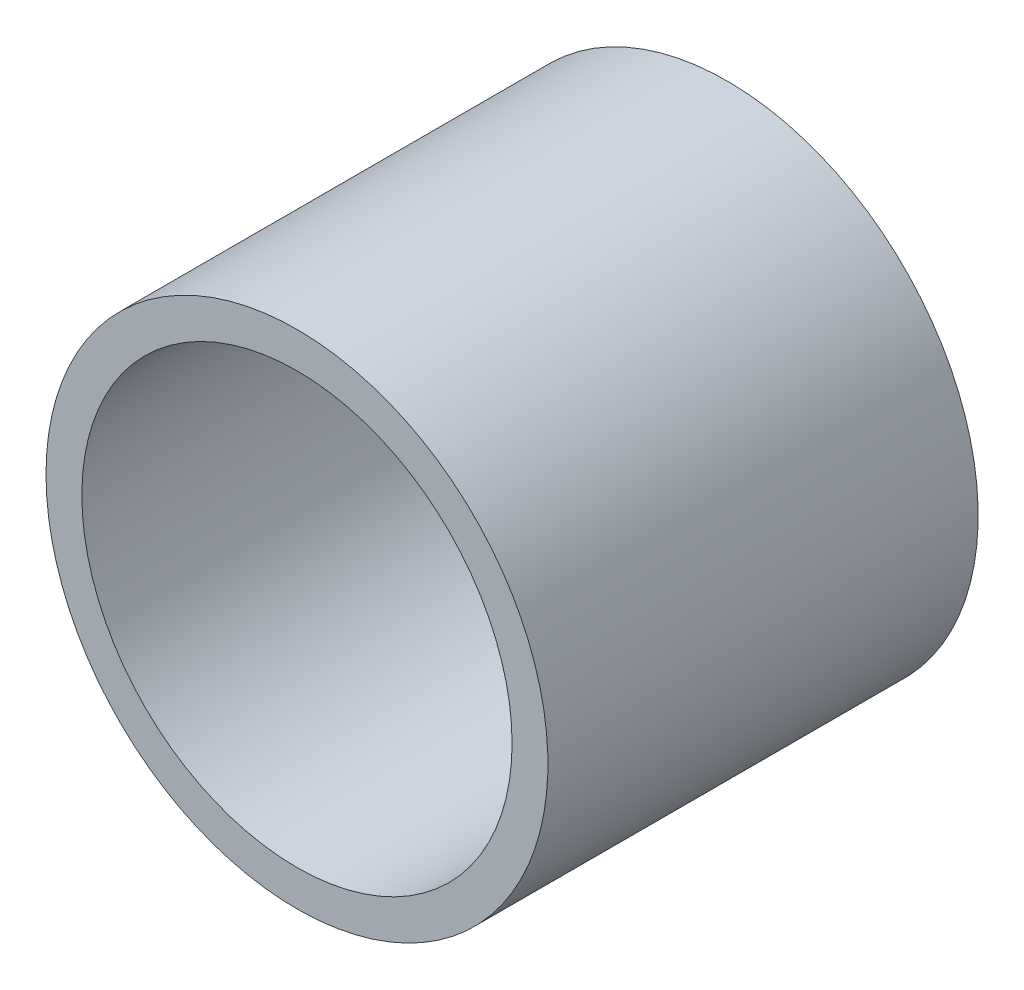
ISO-10303-21;
HEADER;
FILE_DESCRIPTION(('STEP AP214'),'2;1');
FILE_NAME('part.step','',(''),(''),'','','');
FILE_SCHEMA(('AUTOMOTIVE_DESIGN { 1 0 10303 214 1 1 1 1 }'));
ENDSEC;
DATA;
#1=APPLICATION_CONTEXT('core data for automotive mechanical design processes');
#2=APPLICATION_PROTOCOL_DEFINITION('international standard','automotive_design',2000,#1);
#3=PRODUCT_CONTEXT('',#1,'mechanical');
#4=PRODUCT('Part','Part','',(#3));
#5=PRODUCT_RELATED_PRODUCT_CATEGORY('part','',(#4));
#6=PRODUCT_DEFINITION_FORMATION('','',#4);
#7=PRODUCT_DEFINITION_CONTEXT('part definition',#1,'design');
#8=PRODUCT_DEFINITION('design','',#6,#7);
#9=PRODUCT_DEFINITION_SHAPE('','',#8);
#10=(LENGTH_UNIT() NAMED_UNIT(*) SI_UNIT(.MILLI.,.METRE.));
#11=(NAMED_UNIT(*) PLANE_ANGLE_UNIT() SI_UNIT($,.RADIAN.));
#12=(NAMED_UNIT(*) SI_UNIT($,.STERADIAN.) SOLID_ANGLE_UNIT());
#13=UNCERTAINTY_MEASURE_WITH_UNIT(LENGTH_MEASURE(1.E-05),#10,'distance_accuracy_value','');
#14=(GEOMETRIC_REPRESENTATION_CONTEXT(3) GLOBAL_UNCERTAINTY_ASSIGNED_CONTEXT((#13)) GLOBAL_UNIT_ASSIGNED_CONTEXT((#10,
#11,#12)) REPRESENTATION_CONTEXT('',''));
#15=CARTESIAN_POINT('',(0.,0.,0.));
#16=DIRECTION('',(0.,0.,1.));
#17=DIRECTION('',(1.,0.,0.));
#18=AXIS2_PLACEMENT_3D('',#15,#16,#17);
#19=CARTESIAN_POINT('',(0.,0.,17.));
#20=DIRECTION('',(0.,0.,-1.));
#21=DIRECTION('',(-1.,0.,0.));
#22=AXIS2_PLACEMENT_3D('',#19,#20,#21);
#23=CYLINDRICAL_SURFACE('',#22,7.);
#24=CARTESIAN_POINT('',(0.,0.,12.));
#25=DIRECTION('',(0.,0.,-1.));
#26=DIRECTION('',(-1.,0.,0.));
#27=AXIS2_PLACEMENT_3D('',#24,#25,#26);
#28=CIRCLE('',#27,7.);
#29=CARTESIAN_POINT('',(-7.,0.,12.));
#30=VERTEX_POINT('',#29);
#31=EDGE_CURVE('E10',#30,#30,#28,.T.);
#32=ORIENTED_EDGE('',*,*,#31,.T.);
#33=EDGE_LOOP('',(#32));
#34=FACE_BOUND('',#33,.T.);
#35=CARTESIAN_POINT('',(0.,0.,0.));
#36=DIRECTION('',(0.,0.,-1.));
#37=DIRECTION('',(-1.,0.,0.));
#38=AXIS2_PLACEMENT_3D('',#35,#36,#37);
#39=CIRCLE('',#38,7.);
#40=CARTESIAN_POINT('',(-7.,0.,0.));
#41=VERTEX_POINT('',#40);
#42=EDGE_CURVE('E43',#41,#41,#39,.T.);
#43=ORIENTED_EDGE('',*,*,#42,.F.);
#44=EDGE_LOOP('',(#43));
#45=FACE_BOUND('',#44,.T.);
#46=ADVANCED_FACE('F29',(#34,#45),#23,.T.);
#47=CARTESIAN_POINT('',(7.,0.,12.));
#48=DIRECTION('',(0.,0.,1.));
#49=DIRECTION('',(1.,0.,0.));
#50=AXIS2_PLACEMENT_3D('',#47,#48,#49);
#51=PLANE('',#50);
#52=CARTESIAN_POINT('',(0.,0.,12.));
#53=DIRECTION('',(0.,0.,-1.));
#54=DIRECTION('',(-1.,0.,0.));
#55=AXIS2_PLACEMENT_3D('',#52,#53,#54);
#56=CIRCLE('',#55,6.);
#57=CARTESIAN_POINT('',(-6.,0.,12.));
#58=VERTEX_POINT('',#57);
#59=EDGE_CURVE('E35',#58,#58,#56,.T.);
#60=ORIENTED_EDGE('',*,*,#59,.T.);
#61=EDGE_LOOP('',(#60));
#62=FACE_BOUND('',#61,.T.);
#63=ORIENTED_EDGE('',*,*,#31,.F.);
#64=EDGE_LOOP('',(#63));
#65=FACE_BOUND('',#64,.T.);
#66=ADVANCED_FACE('F53',(#62,#65),#51,.T.);
#67=CARTESIAN_POINT('',(0.,0.,17.));
#68=DIRECTION('',(0.,0.,-1.));
#69=DIRECTION('',(-1.,0.,0.));
#70=AXIS2_PLACEMENT_3D('',#67,#68,#69);
#71=CYLINDRICAL_SURFACE('',#70,6.);
#72=CARTESIAN_POINT('',(0.,0.,0.));
#73=DIRECTION('',(0.,0.,-1.));
#74=DIRECTION('',(-1.,0.,0.));
#75=AXIS2_PLACEMENT_3D('',#72,#73,#74);
#76=CIRCLE('',#75,6.);
#77=CARTESIAN_POINT('',(-6.,0.,0.));
#78=VERTEX_POINT('',#77);
#79=EDGE_CURVE('E39',#78,#78,#76,.T.);
#80=ORIENTED_EDGE('',*,*,#79,.T.);
#81=EDGE_LOOP('',(#80));
#82=FACE_BOUND('',#81,.T.);
#83=ORIENTED_EDGE('',*,*,#59,.F.);
#84=EDGE_LOOP('',(#83));
#85=FACE_BOUND('',#84,.T.);
#86=ADVANCED_FACE('F57',(#82,#85),#71,.F.);
#87=CARTESIAN_POINT('',(6.,0.,0.));
#88=DIRECTION('',(0.,0.,-1.));
#89=DIRECTION('',(-1.,0.,0.));
#90=AXIS2_PLACEMENT_3D('',#87,#88,#89);
#91=PLANE('',#90);
#92=ORIENTED_EDGE('',*,*,#42,.T.);
#93=EDGE_LOOP('',(#92));
#94=FACE_BOUND('',#93,.T.);
#95=ORIENTED_EDGE('',*,*,#79,.F.);
#96=EDGE_LOOP('',(#95));
#97=FACE_BOUND('',#96,.T.);
#98=ADVANCED_FACE('F49',(#94,#97),#91,.T.);
#99=CLOSED_SHELL('',(#46,#66,#86,#98));
#100=MANIFOLD_SOLID_BREP('B2',#99);
#101=ADVANCED_BREP_SHAPE_REPRESENTATION('',(#18,#100),#14);
#102=SHAPE_DEFINITION_REPRESENTATION(#9,#101);
ENDSEC;
END-ISO-10303-21;
